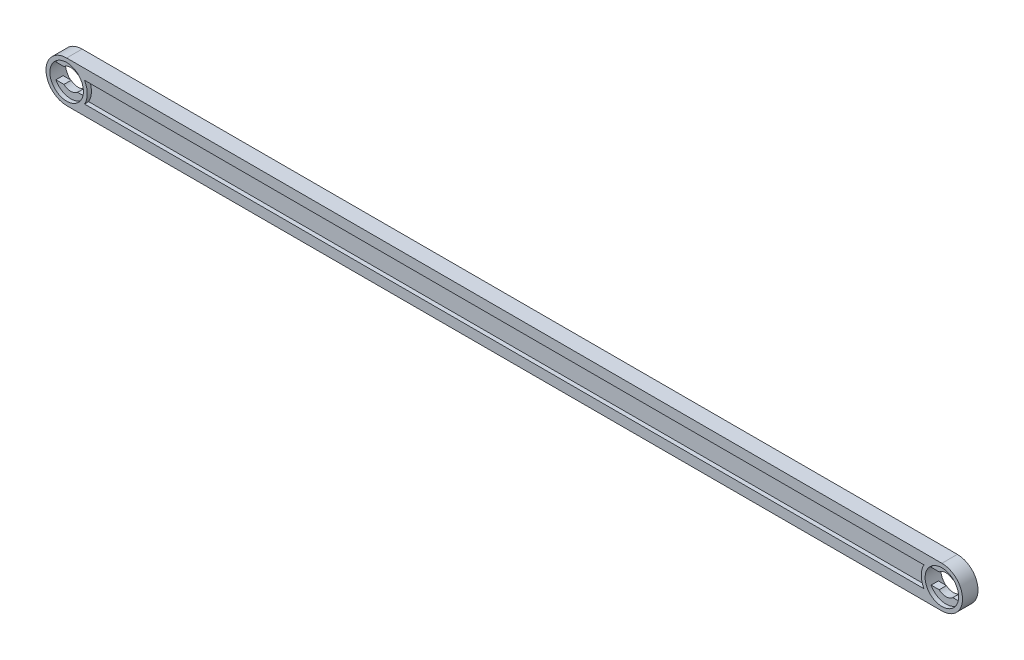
from build123d import *

# Parameters (mm, degrees)
EXTRUDE_1_DEPTH        = 3
CUT_EXTRUDE_1_REACH    = 175.672
SKETCH_3_R             = 3.25
CUT_EXTRUDE_2_DEPTH    = 0.8
CUT_EXTRUDE_START      = -2.2
SKETCH_3_2_R           = 3.25
CUT_EXTRUDE_3_DEPTH    = 0.8
PATTERN_LINEAR_1_COUNT = 2
PATTERN_LINEAR_1_PITCH = 169.6
CUT_EXTRUDE_4_DEPTH    = 0.8
SKETCH_5_W             = 161.6
SKETCH_5_H             = 4
CUT_EXTRUDE_5_DEPTH    = 0.8


with BuildPart() as part:
    # Sketch 1 → Extrude 1 (new body)
    with BuildSketch(Plane.XY):
        with BuildLine():
            Line((0, 4), (169.6, 4))
            ThreePointArc((169.6, 4), (173.6, 0), (169.6, -4))
            Line((169.6, -4), (0, -4))
            ThreePointArc((0, -4), (-4, 0), (0, 4))
        make_face()
    extrude(amount=-EXTRUDE_1_DEPTH)

    # Sketch 2 → Cut-Extrude 1 (cut, up to next)
    with BuildSketch(Plane.XY, mode=Mode.PRIVATE) as cut_extrude_1_sk1:
        with BuildLine():
            Line((1.322875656, -1.5), (2.883140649, -1.5))
            ThreePointArc((2.883140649, -1.5), (3.25, 0), (2.883140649, 1.5))
            Line((2.883140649, 1.5), (1.322875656, 1.5))
            ThreePointArc((1.322875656, 1.5), (0, 2), (-1.322875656, 1.5))
            Line((-1.322875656, 1.5), (-2.883140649, 1.5))
            ThreePointArc((-2.883140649, 1.5), (-3.25, 0), (-2.883140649, -1.5))
            Line((-2.883140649, -1.5), (-1.322875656, -1.5))
            ThreePointArc((-1.322875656, -1.5), (0, -2), (1.322875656, -1.5))
        make_face()
    cut_extrude_1_tool1 = extrude(cut_extrude_1_sk1.sketch, amount=-CUT_EXTRUDE_1_REACH, mode=Mode.PRIVATE) & part.part
    cut_extrude_1 = cut_extrude_1_tool1.solids().sort_by_distance((0, 0, 0))[0]
    add(cut_extrude_1, mode=Mode.SUBTRACT)

    # Sketch 3 → Cut-Extrude 2 (cut)
    with BuildSketch(Plane.XY):
        Circle(SKETCH_3_R)
    cut_extrude_2 = extrude(amount=-CUT_EXTRUDE_2_DEPTH, mode=Mode.SUBTRACT)

    # Sketch 3_2 → Cut-Extrude 3 (cut)
    with BuildSketch(Plane.XY.offset(CUT_EXTRUDE_START)):
        Circle(SKETCH_3_2_R)
    cut_extrude_3 = extrude(amount=-CUT_EXTRUDE_3_DEPTH, mode=Mode.SUBTRACT)

    # Pattern Linear 1: Cut-Extrude 1, Cut-Extrude 2, Cut-Extrude 3 ×2
    with Locations(*[(i * PATTERN_LINEAR_1_PITCH, 0, 0) for i in range(1, PATTERN_LINEAR_1_COUNT)]):
        add(cut_extrude_1, mode=Mode.SUBTRACT)
        add(cut_extrude_2, mode=Mode.SUBTRACT)
        add(cut_extrude_3, mode=Mode.SUBTRACT)

    # Sketch 4 → Cut-Extrude 4 (cut)
    with BuildSketch(Plane.XY):
        with BuildLine():
            Line((3.464101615, 2), (166.135898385, 2))
            ThreePointArc((166.135898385, 2), (165.6, 0), (166.135898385, -2))
            Line((166.135898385, -2), (3.464101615, -2))
            ThreePointArc((3.464101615, -2), (4, 0), (3.464101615, 2))
        make_face()
    extrude(amount=-CUT_EXTRUDE_4_DEPTH, mode=Mode.SUBTRACT)

    # Sketch 5 → Cut-Extrude 5 (cut)
    with BuildSketch(Plane(origin=(0, 0, -3), x_dir=(-1, 0, 0), z_dir=(0, 0, -1))):
        with Locations((-84.8, 0)):
            Rectangle(SKETCH_5_W, SKETCH_5_H)
    extrude(amount=-CUT_EXTRUDE_5_DEPTH, mode=Mode.SUBTRACT)


solid = part.part
